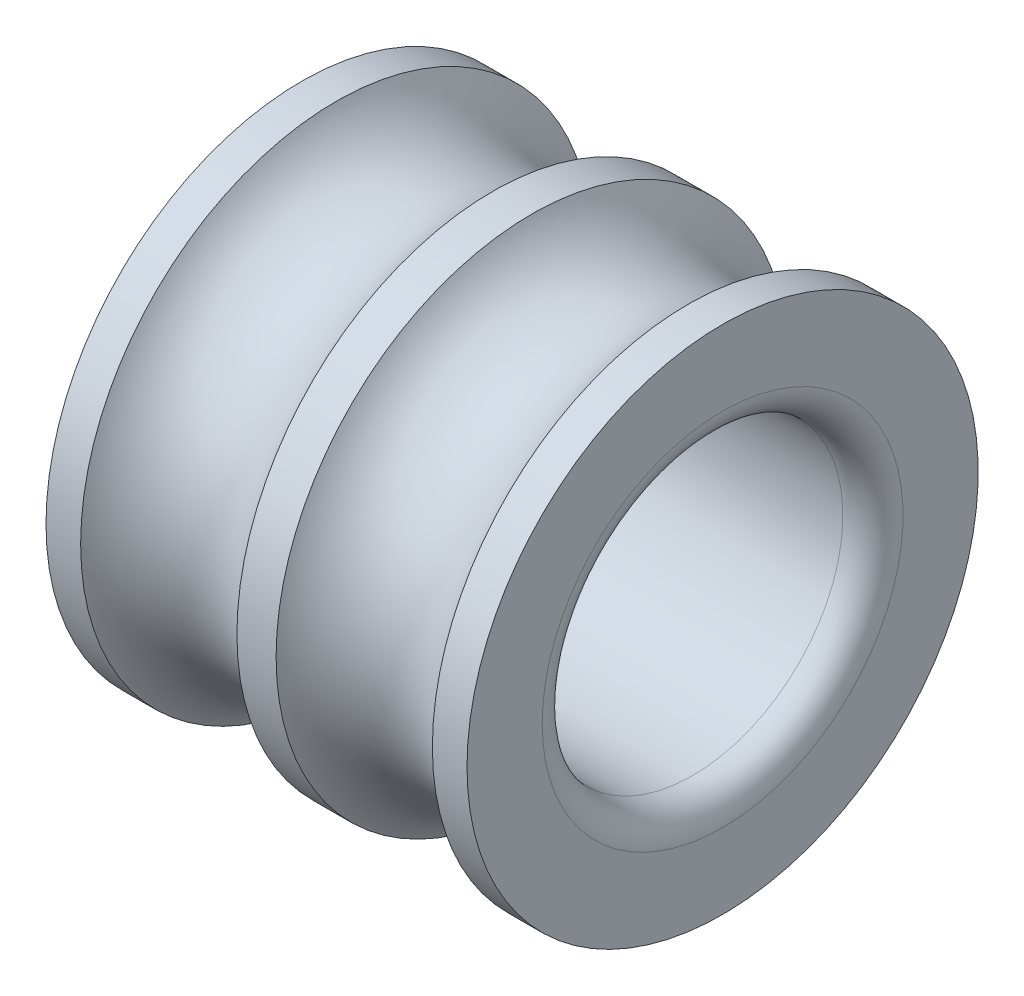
from build123d import *

# Parameters (mm, degrees)
CONG_1_R = 1


with BuildPart() as part:
    # Esquisse1 → Base-R_volution (revolve)
    with BuildSketch(Plane.XY, mode=Mode.PRIVATE) as base_r_volution_sk:
        with BuildLine():
            Line((0, 5), (14, 5))
            Line((14, 5), (14, 8.5))
            Line((14, 8.5), (12.848076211, 8.5))
            ThreePointArc((12.848076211, 8.5), (10.25, 7), (7.651923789, 8.5))
            Line((7.651923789, 8.5), (6.348076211, 8.5))
            ThreePointArc((6.348076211, 8.5), (3.75, 7), (1.151923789, 8.5))
            Line((1.151923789, 8.5), (0, 8.5))
            Line((0, 8.5), (0, 5))
        make_face()
    revolve(base_r_volution_sk.sketch.rotate(Axis((0, 0, 0), (1, 0, 0)), 90), axis=Axis((0, 0, 0), (1, 0, 0)))

    # Cong_1
    cong_1_edges = [part.edges().sort_by_distance(p)[0] for p in [
        (0, 0, -5),
        (14, 0, -5),
    ]]
    fillet(cong_1_edges, radius=CONG_1_R)


solid = part.part
